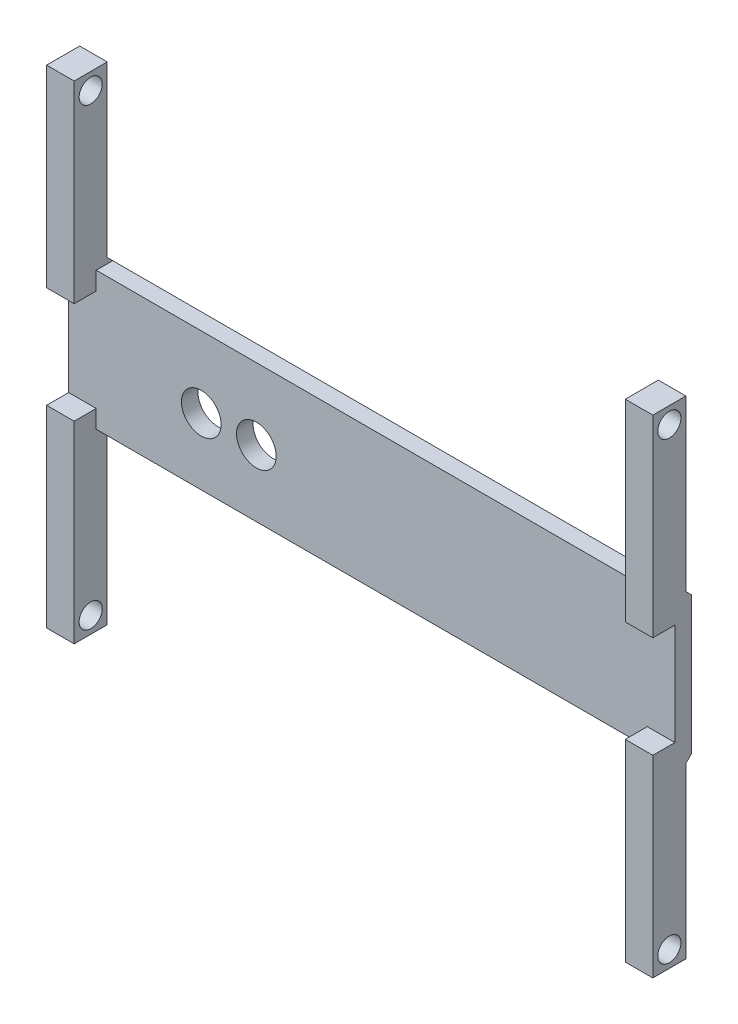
from build123d import *

# Parameters (mm, degrees)
CROQUIS1_W              = 116
CROQUIS1_H              = 25
SALIENTE_EXTRUIR1_DEPTH = 3
SKETCH3_R               = 3.6
CUT_EXTRUDE1_DEPTH      = 5
BOSS_EXTRUDE1_DEPTH     = 8
BOSS_EXTRUDE2_DEPTH     = 8
CUT_EXTRUDE2_DEPTH      = 3
CUT_EXTRUDE3_DEPTH      = 3
SKETCH12_R              = 2.1
CUT_EXTRUDE4_DEPTH      = 5
CUT_EXTRUDE5_START      = -5
SKETCH13_R              = 2.1
CUT_EXTRUDE5_DEPTH      = 5
SKETCH14_W              = 3
SKETCH14_H              = 25
CUT_EXTRUDE6_DEPTH      = 10


with BuildPart() as part:
    # Croquis1 → Saliente-Extruir1 (new body)
    with BuildSketch(Plane.XY):
        Rectangle(CROQUIS1_W, CROQUIS1_H)
    extrude(amount=SALIENTE_EXTRUIR1_DEPTH)

    # Sketch3 → Cut-Extrude1 (cut)
    with BuildSketch(Plane.XY.offset(3)):
        with Locations((-20.939002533, -0.444762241)):
            Circle(SKETCH3_R)
        with Locations((-30.939002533, -0.444762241)):
            Circle(SKETCH3_R)
    extrude(amount=-CUT_EXTRUDE1_DEPTH, mode=Mode.SUBTRACT)

    # Sketch6 → Boss-Extrude1 (add)
    with BuildSketch(Plane.ZY.offset(-58)):
        Polygon((1, -44.229744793), (7, -44.229744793), (7, -9.229744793), (3, -9.229744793), (0, -9.229744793), (0, -12.5), (1, -13.5), align=None)
        Polygon((1, 44.229744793), (1, 13.5), (0, 12.5), (0, 9.229744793), (3, 9.229744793), (7, 9.229744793), (7, 44.229744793), align=None)
    extrude(amount=BOSS_EXTRUDE1_DEPTH)

    # Sketch7 → Boss-Extrude2 (add)
    with BuildSketch(Plane.ZY.offset(58)):
        Polygon((0, 12.5), (1, 13.5), (1, 44.229744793), (7, 44.229744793), (7, 9.229744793), (3, 9.229744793), (3, 12.5), align=None)
        Polygon((3, -12.5), (0, -12.5), (1, -13.5), (1, -44.229744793), (7, -44.229744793), (7, -9.229744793), (3, -9.229744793), align=None)
    extrude(amount=-BOSS_EXTRUDE2_DEPTH)

    # Sketch10 → Cut-Extrude2 (cut)
    with BuildSketch(Plane.ZY.offset(58)):
        Polygon((1, 44.229744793), (1, 13.5), (0, 12.5), (3, 12.5), (3, 9.229744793), (7, 9.229744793), (7, 44.229744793), align=None)
        Polygon((7, -9.229744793), (7, -44.229744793), (1, -44.229744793), (1, -13.5), (0, -12.5), (3, -12.5), (3, -9.229744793), align=None)
    extrude(amount=-CUT_EXTRUDE2_DEPTH, mode=Mode.SUBTRACT)

    # Sketch11 → Cut-Extrude3 (cut)
    with BuildSketch(Plane(origin=(58, 0, 0), x_dir=(0, 0, -1), z_dir=(1, 0, 0))):
        Polygon((-1, 44.229744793), (-1, 13.5), (0, 12.5), (-3, 12.5), (-3, 9.229744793), (-7, 9.229744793), (-7, 44.229744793), align=None)
        Polygon((-7, -9.229744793), (-7, -44.229744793), (-1, -44.229744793), (-1, -13.5), (0, -12.5), (-3, -12.5), (-3, -9.229744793), align=None)
    extrude(amount=-CUT_EXTRUDE3_DEPTH, mode=Mode.SUBTRACT)

    # Sketch12 → Cut-Extrude4 (cut)
    with BuildSketch(Plane(origin=(-50, 0, 0), x_dir=(0, 0, -1), z_dir=(1, 0, 0))):
        with Locations((-4, -41.229744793)):
            Circle(SKETCH12_R)
        with Locations((-4, 41.229744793)):
            Circle(SKETCH12_R)
    extrude(amount=-CUT_EXTRUDE4_DEPTH, mode=Mode.SUBTRACT)

    # Sketch13 → Cut-Extrude5 (cut)
    with BuildSketch(Plane.ZY.offset(-50).offset(CUT_EXTRUDE5_START)):
        with Locations(Location((4, 41.229744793, 0), (0, 0, 180))):
            Circle(SKETCH13_R)
        with Locations(Location((4, -41.229744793, 0), (0, 0, 180))):
            Circle(SKETCH13_R)
    extrude(amount=CUT_EXTRUDE5_DEPTH, mode=Mode.SUBTRACT)

    # Sketch14 → Cut-Extrude6 (cut)
    with BuildSketch(Plane.XY.offset(3)):
        with Locations((-56.5, 0)):
            Rectangle(SKETCH14_W, SKETCH14_H)
        with Locations((56.5, 0)):
            Rectangle(SKETCH14_W, SKETCH14_H)
    extrude(amount=-CUT_EXTRUDE6_DEPTH, mode=Mode.SUBTRACT)


solid = part.part
